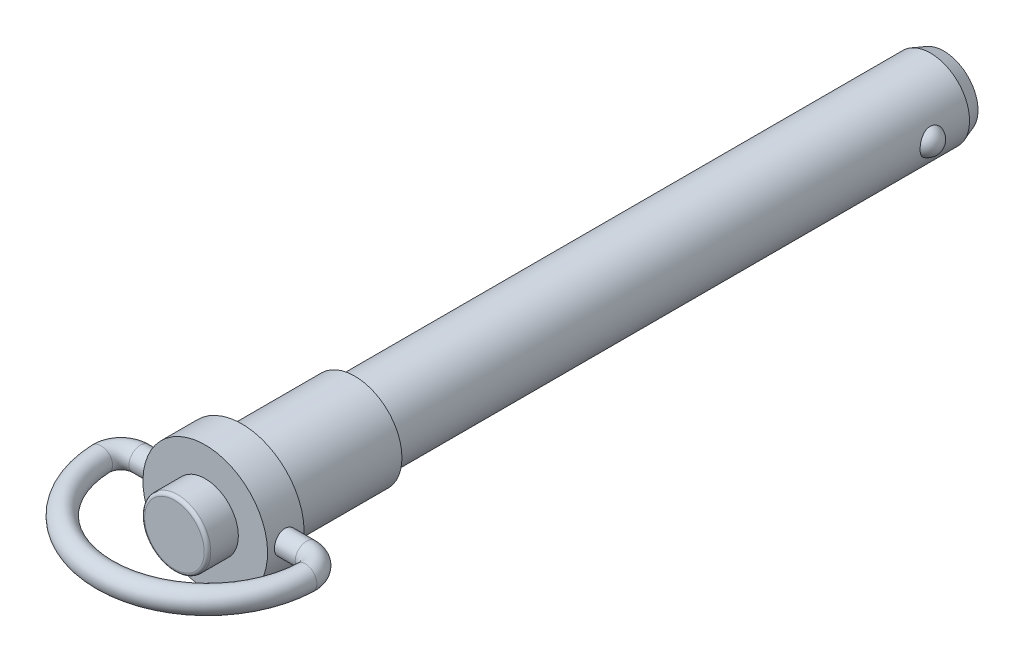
ISO-10303-21;
HEADER;
FILE_DESCRIPTION(('STEP AP214'),'2;1');
FILE_NAME('part.step','',(''),(''),'','','');
FILE_SCHEMA(('AUTOMOTIVE_DESIGN { 1 0 10303 214 1 1 1 1 }'));
ENDSEC;
DATA;
#1=APPLICATION_CONTEXT('core data for automotive mechanical design processes');
#2=APPLICATION_PROTOCOL_DEFINITION('international standard','automotive_design',2000,#1);
#3=PRODUCT_CONTEXT('',#1,'mechanical');
#4=PRODUCT('Part','Part','',(#3));
#5=PRODUCT_RELATED_PRODUCT_CATEGORY('part','',(#4));
#6=PRODUCT_DEFINITION_FORMATION('','',#4);
#7=PRODUCT_DEFINITION_CONTEXT('part definition',#1,'design');
#8=PRODUCT_DEFINITION('design','',#6,#7);
#9=PRODUCT_DEFINITION_SHAPE('','',#8);
#10=(LENGTH_UNIT() NAMED_UNIT(*) SI_UNIT(.MILLI.,.METRE.));
#11=(NAMED_UNIT(*) PLANE_ANGLE_UNIT() SI_UNIT($,.RADIAN.));
#12=(NAMED_UNIT(*) SI_UNIT($,.STERADIAN.) SOLID_ANGLE_UNIT());
#13=UNCERTAINTY_MEASURE_WITH_UNIT(LENGTH_MEASURE(1.E-05),#10,'distance_accuracy_value','');
#14=(GEOMETRIC_REPRESENTATION_CONTEXT(3) GLOBAL_UNCERTAINTY_ASSIGNED_CONTEXT((#13)) GLOBAL_UNIT_ASSIGNED_CONTEXT((#10,
#11,#12)) REPRESENTATION_CONTEXT('',''));
#15=CARTESIAN_POINT('',(0.,0.,0.));
#16=DIRECTION('',(0.,0.,1.));
#17=DIRECTION('',(1.,0.,0.));
#18=AXIS2_PLACEMENT_3D('',#15,#16,#17);
#19=CARTESIAN_POINT('',(0.,0.,27.575));
#20=DIRECTION('',(0.,0.,1.));
#21=DIRECTION('',(1.,0.,0.));
#22=AXIS2_PLACEMENT_3D('',#19,#20,#21);
#23=PLANE('',#22);
#24=CARTESIAN_POINT('',(0.,0.,27.575));
#25=DIRECTION('',(0.,0.,1.));
#26=DIRECTION('',(1.,0.,0.));
#27=AXIS2_PLACEMENT_3D('',#24,#25,#26);
#28=CIRCLE('',#27,4.5546);
#29=CARTESIAN_POINT('',(4.5546,0.,27.575));
#30=VERTEX_POINT('',#29);
#31=EDGE_CURVE('E144',#30,#30,#28,.T.);
#32=ORIENTED_EDGE('',*,*,#31,.T.);
#33=EDGE_LOOP('',(#32));
#34=FACE_BOUND('',#33,.T.);
#35=ADVANCED_FACE('F12',(#34),#23,.T.);
#36=CARTESIAN_POINT('',(0.,0.,22.5357550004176));
#37=DIRECTION('',(0.,1.,0.));
#38=DIRECTION('',(0.,0.,1.));
#39=AXIS2_PLACEMENT_3D('',#36,#37,#38);
#40=TOROIDAL_SURFACE('',#39,15.6980038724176,1.75);
#41=CARTESIAN_POINT('',(-15.6851704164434,0.,23.1703844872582));
#42=DIRECTION('',(-0.0404274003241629,0.,-0.999182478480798));
#43=DIRECTION('',(-0.999182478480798,0.,0.0404274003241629));
#44=AXIS2_PLACEMENT_3D('',#41,#42,#43);
#45=CIRCLE('',#44,1.75);
#46=CARTESIAN_POINT('',(-17.4337397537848,0.,23.2411324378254));
#47=VERTEX_POINT('',#46);
#48=EDGE_CURVE('E145',#47,#47,#45,.T.);
#49=CARTESIAN_POINT('',(15.6851704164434,0.,23.1703844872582));
#50=DIRECTION('',(-0.0404274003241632,0.,0.999182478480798));
#51=DIRECTION('',(0.999182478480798,0.,0.0404274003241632));
#52=AXIS2_PLACEMENT_3D('',#49,#50,#51);
#53=CIRCLE('',#52,1.75);
#54=CARTESIAN_POINT('',(17.4337397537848,0.,23.2411324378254));
#55=VERTEX_POINT('',#54);
#56=EDGE_CURVE('E137',#55,#55,#53,.T.);
#57=CARTESIAN_POINT('',(0.,0.,22.5357550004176));
#58=DIRECTION('',(0.,1.,0.));
#59=DIRECTION('',(0.,0.,1.));
#60=AXIS2_PLACEMENT_3D('',#57,#58,#59);
#61=CIRCLE('',#60,17.4480038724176);
#62=EDGE_CURVE('',#47,#55,#61,.T.);
#63=ORIENTED_EDGE('',*,*,#48,.F.);
#64=ORIENTED_EDGE('',*,*,#56,.T.);
#65=ORIENTED_EDGE('',*,*,#62,.T.);
#66=ORIENTED_EDGE('',*,*,#62,.F.);
#67=EDGE_LOOP('',(#63,#65,#64,#66));
#68=FACE_BOUND('',#67,.T.);
#69=ADVANCED_FACE('F74',(#68),#40,.T.);
#70=CARTESIAN_POINT('',(0.,0.,27.075));
#71=DIRECTION('',(0.,0.,1.));
#72=DIRECTION('',(1.,0.,0.));
#73=AXIS2_PLACEMENT_3D('',#70,#71,#72);
#74=TOROIDAL_SURFACE('',#73,4.5546,0.5);
#75=CARTESIAN_POINT('',(0.,0.,27.075));
#76=DIRECTION('',(0.,0.,1.));
#77=DIRECTION('',(1.,0.,0.));
#78=AXIS2_PLACEMENT_3D('',#75,#76,#77);
#79=CIRCLE('',#78,5.0546);
#80=CARTESIAN_POINT('',(5.0546,0.,27.075));
#81=VERTEX_POINT('',#80);
#82=EDGE_CURVE('E150',#81,#81,#79,.T.);
#83=ORIENTED_EDGE('',*,*,#82,.T.);
#84=EDGE_LOOP('',(#83));
#85=FACE_BOUND('',#84,.T.);
#86=ORIENTED_EDGE('',*,*,#31,.F.);
#87=EDGE_LOOP('',(#86));
#88=FACE_BOUND('',#87,.T.);
#89=ADVANCED_FACE('F80',(#85,#88),#74,.T.);
#90=CARTESIAN_POINT('',(12.7038508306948,0.,23.0497588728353));
#91=DIRECTION('',(0.,1.,0.));
#92=DIRECTION('',(0.,0.,1.));
#93=AXIS2_PLACEMENT_3D('',#90,#91,#92);
#94=TOROIDAL_SURFACE('',#93,2.98375887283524,1.75);
#95=CARTESIAN_POINT('',(12.7038508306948,0.,20.066));
#96=DIRECTION('',(1.,0.,0.));
#97=DIRECTION('',(0.,0.,-1.));
#98=AXIS2_PLACEMENT_3D('',#95,#96,#97);
#99=CIRCLE('',#98,1.75);
#100=CARTESIAN_POINT('',(12.7038508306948,0.,18.316));
#101=VERTEX_POINT('',#100);
#102=EDGE_CURVE('E140',#101,#101,#99,.T.);
#103=CARTESIAN_POINT('',(12.7038508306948,0.,23.0497588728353));
#104=DIRECTION('',(0.,1.,0.));
#105=DIRECTION('',(0.,0.,1.));
#106=AXIS2_PLACEMENT_3D('',#103,#104,#105);
#107=CIRCLE('',#106,4.73375887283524);
#108=EDGE_CURVE('',#55,#101,#107,.T.);
#109=ORIENTED_EDGE('',*,*,#56,.F.);
#110=ORIENTED_EDGE('',*,*,#102,.T.);
#111=ORIENTED_EDGE('',*,*,#108,.T.);
#112=ORIENTED_EDGE('',*,*,#108,.F.);
#113=EDGE_LOOP('',(#109,#111,#110,#112));
#114=FACE_BOUND('',#113,.T.);
#115=ADVANCED_FACE('F90',(#114),#94,.T.);
#116=CARTESIAN_POINT('',(-12.7038508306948,0.,23.0497588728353));
#117=DIRECTION('',(0.,1.,0.));
#118=DIRECTION('',(0.,0.,1.));
#119=AXIS2_PLACEMENT_3D('',#116,#117,#118);
#120=TOROIDAL_SURFACE('',#119,2.98375887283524,1.75);
#121=CARTESIAN_POINT('',(-12.7038508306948,0.,20.066));
#122=DIRECTION('',(1.,0.,0.));
#123=DIRECTION('',(0.,0.,-1.));
#124=AXIS2_PLACEMENT_3D('',#121,#122,#123);
#125=CIRCLE('',#124,1.75);
#126=CARTESIAN_POINT('',(-12.7038508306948,0.,18.316));
#127=VERTEX_POINT('',#126);
#128=EDGE_CURVE('E307',#127,#127,#125,.T.);
#129=CARTESIAN_POINT('',(-12.7038508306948,0.,23.0497588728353));
#130=DIRECTION('',(0.,1.,0.));
#131=DIRECTION('',(0.,0.,1.));
#132=AXIS2_PLACEMENT_3D('',#129,#130,#131);
#133=CIRCLE('',#132,4.73375887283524);
#134=EDGE_CURVE('',#127,#47,#133,.T.);
#135=ORIENTED_EDGE('',*,*,#128,.F.);
#136=ORIENTED_EDGE('',*,*,#48,.T.);
#137=ORIENTED_EDGE('',*,*,#134,.T.);
#138=ORIENTED_EDGE('',*,*,#134,.F.);
#139=EDGE_LOOP('',(#135,#137,#136,#138));
#140=FACE_BOUND('',#139,.T.);
#141=ADVANCED_FACE('F105',(#140),#120,.T.);
#142=CARTESIAN_POINT('',(0.,0.,28.575));
#143=DIRECTION('',(0.,0.,-1.));
#144=DIRECTION('',(0.,-1.,0.));
#145=AXIS2_PLACEMENT_3D('',#142,#143,#144);
#146=CYLINDRICAL_SURFACE('',#145,5.0546);
#147=ORIENTED_EDGE('',*,*,#82,.F.);
#148=EDGE_LOOP('',(#147));
#149=FACE_BOUND('',#148,.T.);
#150=CARTESIAN_POINT('',(0.,0.,22.86));
#151=DIRECTION('',(0.,0.,-1.));
#152=DIRECTION('',(0.,-1.,0.));
#153=AXIS2_PLACEMENT_3D('',#150,#151,#152);
#154=CIRCLE('',#153,5.0546);
#155=CARTESIAN_POINT('',(0.,-5.0546,22.86));
#156=VERTEX_POINT('',#155);
#157=EDGE_CURVE('E122',#156,#156,#154,.T.);
#158=ORIENTED_EDGE('',*,*,#157,.F.);
#159=EDGE_LOOP('',(#158));
#160=FACE_BOUND('',#159,.T.);
#161=ADVANCED_FACE('F102',(#149,#160),#146,.T.);
#162=CARTESIAN_POINT('',(12.7038508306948,0.,20.066));
#163=DIRECTION('',(-1.,0.,0.));
#164=DIRECTION('',(0.,0.,1.));
#165=AXIS2_PLACEMENT_3D('',#162,#163,#164);
#166=CYLINDRICAL_SURFACE('',#165,1.75);
#167=CARTESIAN_POINT('',(9.525,0.,21.816));
#168=CARTESIAN_POINT('',(9.52499824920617,0.0974196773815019,21.8159962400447));
#169=CARTESIAN_POINT('',(9.52348996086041,0.194888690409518,21.8078377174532));
#170=CARTESIAN_POINT('',(9.51761845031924,0.387082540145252,21.7754387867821));
#171=CARTESIAN_POINT('',(9.5132527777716,0.481804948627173,21.7511845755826));
#172=CARTESIAN_POINT('',(9.50215510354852,0.66569803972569,21.6873599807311));
#173=CARTESIAN_POINT('',(9.49542520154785,0.75487356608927,21.6478031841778));
#174=CARTESIAN_POINT('',(9.48033492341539,0.925313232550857,21.5545343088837));
#175=CARTESIAN_POINT('',(9.4719746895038,1.00657806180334,21.5008234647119));
#176=CARTESIAN_POINT('',(9.45443959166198,1.15983447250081,21.38011409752));
#177=CARTESIAN_POINT('',(9.44525721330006,1.23172173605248,21.3129842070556));
#178=CARTESIAN_POINT('',(9.42716883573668,1.36328019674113,21.1676249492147));
#179=CARTESIAN_POINT('',(9.41826285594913,1.42295053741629,21.0893948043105));
#180=CARTESIAN_POINT('',(9.40166266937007,1.52881224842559,20.9233223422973));
#181=CARTESIAN_POINT('',(9.39397815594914,1.57489805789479,20.8354116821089));
#182=CARTESIAN_POINT('',(9.3807965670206,1.65160688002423,20.6529311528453));
#183=CARTESIAN_POINT('',(9.3752993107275,1.68223117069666,20.5583618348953));
#184=CARTESIAN_POINT('',(9.36719014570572,1.72681399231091,20.3663627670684));
#185=CARTESIAN_POINT('',(9.36454682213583,1.74095411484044,20.2689765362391));
#186=CARTESIAN_POINT('',(9.36235004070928,1.75273074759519,20.0731807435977));
#187=CARTESIAN_POINT('',(9.3627963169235,1.75036867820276,19.9747712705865));
#188=CARTESIAN_POINT('',(9.36669969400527,1.72935535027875,19.7810343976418));
#189=CARTESIAN_POINT('',(9.37011871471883,1.71091010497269,19.6856837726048));
#190=CARTESIAN_POINT('',(9.37952256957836,1.65857824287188,19.49945389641));
#191=CARTESIAN_POINT('',(9.38550750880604,1.62469099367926,19.4085748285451));
#192=CARTESIAN_POINT('',(9.39940890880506,1.54223419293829,19.2332623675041));
#193=CARTESIAN_POINT('',(9.40733632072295,1.49358101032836,19.1488692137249));
#194=CARTESIAN_POINT('',(9.42422213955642,1.38303261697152,18.98936699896));
#195=CARTESIAN_POINT('',(9.43318064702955,1.32113611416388,18.9142588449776));
#196=CARTESIAN_POINT('',(9.45128545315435,1.184745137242,18.77426795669));
#197=CARTESIAN_POINT('',(9.46043254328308,1.11007434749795,18.7095569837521));
#198=CARTESIAN_POINT('',(9.47775926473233,0.950845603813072,18.5935547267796));
#199=CARTESIAN_POINT('',(9.48593888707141,0.866287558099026,18.5422635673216));
#200=CARTESIAN_POINT('',(9.50042458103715,0.689508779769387,18.4545334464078));
#201=CARTESIAN_POINT('',(9.50672846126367,0.597279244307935,18.4181118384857));
#202=CARTESIAN_POINT('',(9.51673535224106,0.407869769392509,18.3613256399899));
#203=CARTESIAN_POINT('',(9.52043862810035,0.310690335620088,18.3409594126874));
#204=CARTESIAN_POINT('',(9.5247907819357,0.115617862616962,18.3170999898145));
#205=CARTESIAN_POINT('',(9.52548227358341,0.0177545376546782,18.313371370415));
#206=CARTESIAN_POINT('',(9.52385046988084,-0.17719740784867,18.3222622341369));
#207=CARTESIAN_POINT('',(9.52152731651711,-0.274286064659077,18.3348809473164));
#208=CARTESIAN_POINT('',(9.51415375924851,-0.46418965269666,18.3759125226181));
#209=CARTESIAN_POINT('',(9.50912384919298,-0.557031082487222,18.4042067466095));
#210=CARTESIAN_POINT('',(9.49689842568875,-0.736652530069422,18.4756581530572));
#211=CARTESIAN_POINT('',(9.48970276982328,-0.823432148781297,18.5188163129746));
#212=CARTESIAN_POINT('',(9.47383776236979,-0.98947475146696,18.6192949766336));
#213=CARTESIAN_POINT('',(9.46515367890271,-1.06864888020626,18.676759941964));
#214=CARTESIAN_POINT('',(9.44731421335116,-1.21631462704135,18.8040249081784));
#215=CARTESIAN_POINT('',(9.43815878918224,-1.28480528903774,18.873826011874));
#216=CARTESIAN_POINT('',(9.42026781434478,-1.41005035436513,19.0248458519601));
#217=CARTESIAN_POINT('',(9.41153908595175,-1.46664438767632,19.1061985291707));
#218=CARTESIAN_POINT('',(9.39562517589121,-1.56536359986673,19.277394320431));
#219=CARTESIAN_POINT('',(9.38843993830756,-1.60748930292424,19.3672371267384));
#220=CARTESIAN_POINT('',(9.3764796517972,-1.67584630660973,19.5524479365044));
#221=CARTESIAN_POINT('',(9.37169329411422,-1.70215230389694,19.6477876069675));
#222=CARTESIAN_POINT('',(9.36504636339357,-1.73835449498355,19.8416293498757));
#223=CARTESIAN_POINT('',(9.36318547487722,-1.7482524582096,19.9401310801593));
#224=CARTESIAN_POINT('',(9.3626157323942,-1.75130025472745,20.1358954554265));
#225=CARTESIAN_POINT('',(9.36385929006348,-1.74470294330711,20.2331541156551));
#226=CARTESIAN_POINT('',(9.36925303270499,-1.71549975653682,20.4251511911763));
#227=CARTESIAN_POINT('',(9.37340320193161,-1.69289396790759,20.5198896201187));
#228=CARTESIAN_POINT('',(9.38412287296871,-1.63242039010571,20.7040281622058));
#229=CARTESIAN_POINT('',(9.39068820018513,-1.5945789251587,20.7934371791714));
#230=CARTESIAN_POINT('',(9.40550157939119,-1.50473547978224,20.964677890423));
#231=CARTESIAN_POINT('',(9.41374974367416,-1.45273255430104,21.0465090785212));
#232=CARTESIAN_POINT('',(9.43114776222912,-1.33515884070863,21.2015399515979));
#233=CARTESIAN_POINT('',(9.44030888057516,-1.26940363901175,21.2745985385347));
#234=CARTESIAN_POINT('',(9.45841527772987,-1.12657740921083,21.4087295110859));
#235=CARTESIAN_POINT('',(9.4673605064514,-1.04950378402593,21.4697991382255));
#236=CARTESIAN_POINT('',(9.4841172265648,-0.885436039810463,21.5787070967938));
#237=CARTESIAN_POINT('',(9.49191831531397,-0.798362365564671,21.6264272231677));
#238=CARTESIAN_POINT('',(9.50540634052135,-0.617319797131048,21.7064857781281));
#239=CARTESIAN_POINT('',(9.51109528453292,-0.523357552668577,21.7388388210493));
#240=CARTESIAN_POINT('',(9.51854259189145,-0.357584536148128,21.7805891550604));
#241=CARTESIAN_POINT('',(9.52095058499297,-0.286749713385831,21.7938458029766));
#242=CARTESIAN_POINT('',(9.52417991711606,-0.143952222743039,21.8115525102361));
#243=CARTESIAN_POINT('',(9.52500129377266,-0.0719895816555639,21.8160027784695));
#244=CARTESIAN_POINT('',(9.525,0.,21.816));
#245=B_SPLINE_CURVE_WITH_KNOTS('',3,(#167,#168,#169,#170,#171,#172,#173,#174,#175,#176,#177,
#178,#179,#180,#181,#182,#183,#184,#185,#186,#187,#188,#189,#190,#191,#192,#193,#194,#195,#196,
#197,#198,#199,#200,#201,#202,#203,#204,#205,#206,#207,#208,#209,#210,#211,#212,#213,#214,#215,
#216,#217,#218,#219,#220,#221,#222,#223,#224,#225,#226,#227,#228,#229,#230,#231,#232,#233,#234,
#235,#236,#237,#238,#239,#240,#241,#242,#243,#244),.UNSPECIFIED.,.T.,.F.,(4,2,2,2,2,2,2,2,2,2,2,
2,2,2,2,2,2,2,2,2,2,2,2,2,2,2,2,2,2,2,2,2,2,2,2,2,2,2,4),(0.,0.291995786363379,
0.584242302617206,0.876229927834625,1.16819209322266,1.46316632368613,1.75816122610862,
2.05539140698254,2.35259701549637,2.64649667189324,2.94037103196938,3.23053548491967,
3.52071182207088,3.81256333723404,4.10444333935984,4.40073615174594,4.69703171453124,
4.9936720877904,5.29028221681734,5.58268169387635,5.87506739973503,6.1652698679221,
6.45549142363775,6.74877158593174,7.04207797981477,7.3391152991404,7.63614185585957,
7.93175468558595,8.22733563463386,8.51841349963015,8.80948978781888,9.10006529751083,
9.39066020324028,9.68543533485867,9.98027821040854,10.2776546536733,10.574747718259,
10.7905270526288,11.0063012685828),.UNSPECIFIED.);
#246=CARTESIAN_POINT('',(9.525,0.,21.816));
#247=VERTEX_POINT('',#246);
#248=EDGE_CURVE('E29',#247,#247,#245,.T.);
#249=ORIENTED_EDGE('',*,*,#248,.F.);
#250=EDGE_LOOP('',(#249));
#251=FACE_BOUND('',#250,.T.);
#252=ORIENTED_EDGE('',*,*,#102,.F.);
#253=EDGE_LOOP('',(#252));
#254=FACE_BOUND('',#253,.T.);
#255=ADVANCED_FACE('F85',(#251,#254),#166,.T.);
#256=CARTESIAN_POINT('',(-12.7038508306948,0.,20.066));
#257=DIRECTION('',(1.,0.,0.));
#258=DIRECTION('',(0.,0.,-1.));
#259=AXIS2_PLACEMENT_3D('',#256,#257,#258);
#260=CYLINDRICAL_SURFACE('',#259,1.75);
#261=CARTESIAN_POINT('',(-9.525,0.,18.316));
#262=CARTESIAN_POINT('',(-9.52499824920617,-0.097419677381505,18.3160037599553));
#263=CARTESIAN_POINT('',(-9.52348996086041,-0.194888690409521,18.3241622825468));
#264=CARTESIAN_POINT('',(-9.51761845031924,-0.387082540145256,18.3565612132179));
#265=CARTESIAN_POINT('',(-9.5132527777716,-0.481804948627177,18.3808154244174));
#266=CARTESIAN_POINT('',(-9.50215510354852,-0.665698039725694,18.4446400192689));
#267=CARTESIAN_POINT('',(-9.49542520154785,-0.754873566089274,18.4841968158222));
#268=CARTESIAN_POINT('',(-9.48033492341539,-0.925313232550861,18.5774656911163));
#269=CARTESIAN_POINT('',(-9.4719746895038,-1.00657806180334,18.6311765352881));
#270=CARTESIAN_POINT('',(-9.45443959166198,-1.15983447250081,18.75188590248));
#271=CARTESIAN_POINT('',(-9.44525721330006,-1.23172173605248,18.8190157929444));
#272=CARTESIAN_POINT('',(-9.42716883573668,-1.36328019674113,18.9643750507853));
#273=CARTESIAN_POINT('',(-9.41826285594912,-1.4229505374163,19.0426051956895));
#274=CARTESIAN_POINT('',(-9.40166266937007,-1.52881224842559,19.2086776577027));
#275=CARTESIAN_POINT('',(-9.39397815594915,-1.57489805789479,19.2965883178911));
#276=CARTESIAN_POINT('',(-9.3807965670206,-1.65160688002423,19.4790688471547));
#277=CARTESIAN_POINT('',(-9.3752993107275,-1.68223117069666,19.5736381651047));
#278=CARTESIAN_POINT('',(-9.36719014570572,-1.72681399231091,19.7656372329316));
#279=CARTESIAN_POINT('',(-9.36454682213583,-1.74095411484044,19.8630234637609));
#280=CARTESIAN_POINT('',(-9.36235004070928,-1.7527307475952,20.0588192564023));
#281=CARTESIAN_POINT('',(-9.3627963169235,-1.75036867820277,20.1572287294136));
#282=CARTESIAN_POINT('',(-9.36669969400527,-1.72935535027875,20.3509656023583));
#283=CARTESIAN_POINT('',(-9.37011871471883,-1.71091010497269,20.4463162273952));
#284=CARTESIAN_POINT('',(-9.37952256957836,-1.65857824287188,20.63254610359));
#285=CARTESIAN_POINT('',(-9.38550750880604,-1.62469099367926,20.7234251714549));
#286=CARTESIAN_POINT('',(-9.39940890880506,-1.54223419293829,20.8987376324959));
#287=CARTESIAN_POINT('',(-9.40733632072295,-1.49358101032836,20.9831307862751));
#288=CARTESIAN_POINT('',(-9.42422213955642,-1.38303261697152,21.14263300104));
#289=CARTESIAN_POINT('',(-9.43318064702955,-1.32113611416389,21.2177411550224));
#290=CARTESIAN_POINT('',(-9.45128545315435,-1.184745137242,21.35773204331));
#291=CARTESIAN_POINT('',(-9.46043254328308,-1.11007434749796,21.4224430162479));
#292=CARTESIAN_POINT('',(-9.47775926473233,-0.950845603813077,21.5384452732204));
#293=CARTESIAN_POINT('',(-9.48593888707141,-0.86628755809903,21.5897364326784));
#294=CARTESIAN_POINT('',(-9.50042458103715,-0.689508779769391,21.6774665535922));
#295=CARTESIAN_POINT('',(-9.50672846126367,-0.597279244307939,21.7138881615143));
#296=CARTESIAN_POINT('',(-9.51673535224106,-0.407869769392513,21.7706743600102));
#297=CARTESIAN_POINT('',(-9.52043862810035,-0.310690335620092,21.7910405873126));
#298=CARTESIAN_POINT('',(-9.5247907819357,-0.115617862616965,21.8149000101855));
#299=CARTESIAN_POINT('',(-9.52548227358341,-0.0177545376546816,21.818628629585));
#300=CARTESIAN_POINT('',(-9.52385046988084,0.177197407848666,21.8097377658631));
#301=CARTESIAN_POINT('',(-9.52152731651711,0.274286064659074,21.7971190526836));
#302=CARTESIAN_POINT('',(-9.51415375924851,0.464189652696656,21.7560874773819));
#303=CARTESIAN_POINT('',(-9.50912384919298,0.557031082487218,21.7277932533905));
#304=CARTESIAN_POINT('',(-9.49689842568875,0.736652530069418,21.6563418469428));
#305=CARTESIAN_POINT('',(-9.48970276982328,0.823432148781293,21.6131836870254));
#306=CARTESIAN_POINT('',(-9.47383776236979,0.989474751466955,21.5127050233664));
#307=CARTESIAN_POINT('',(-9.46515367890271,1.06864888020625,21.455240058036));
#308=CARTESIAN_POINT('',(-9.44731421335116,1.21631462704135,21.3279750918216));
#309=CARTESIAN_POINT('',(-9.43815878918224,1.28480528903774,21.258173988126));
#310=CARTESIAN_POINT('',(-9.42026781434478,1.41005035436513,21.1071541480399));
#311=CARTESIAN_POINT('',(-9.41153908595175,1.46664438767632,21.0258014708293));
#312=CARTESIAN_POINT('',(-9.39562517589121,1.56536359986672,20.854605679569));
#313=CARTESIAN_POINT('',(-9.38843993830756,1.60748930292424,20.7647628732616));
#314=CARTESIAN_POINT('',(-9.3764796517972,1.67584630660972,20.5795520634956));
#315=CARTESIAN_POINT('',(-9.37169329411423,1.70215230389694,20.4842123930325));
#316=CARTESIAN_POINT('',(-9.36504636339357,1.73835449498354,20.2903706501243));
#317=CARTESIAN_POINT('',(-9.36318547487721,1.74825245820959,20.1918689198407));
#318=CARTESIAN_POINT('',(-9.3626157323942,1.75130025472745,19.9961045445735));
#319=CARTESIAN_POINT('',(-9.36385929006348,1.74470294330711,19.8988458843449));
#320=CARTESIAN_POINT('',(-9.36925303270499,1.71549975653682,19.7068488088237));
#321=CARTESIAN_POINT('',(-9.3734032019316,1.69289396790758,19.6121103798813));
#322=CARTESIAN_POINT('',(-9.3841228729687,1.6324203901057,19.4279718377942));
#323=CARTESIAN_POINT('',(-9.39068820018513,1.5945789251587,19.3385628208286));
#324=CARTESIAN_POINT('',(-9.40550157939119,1.50473547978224,19.167322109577));
#325=CARTESIAN_POINT('',(-9.41374974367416,1.45273255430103,19.0854909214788));
#326=CARTESIAN_POINT('',(-9.43114776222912,1.33515884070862,18.9304600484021));
#327=CARTESIAN_POINT('',(-9.44030888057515,1.26940363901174,18.8574014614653));
#328=CARTESIAN_POINT('',(-9.45841527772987,1.12657740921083,18.7232704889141));
#329=CARTESIAN_POINT('',(-9.4673605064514,1.04950378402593,18.6622008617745));
#330=CARTESIAN_POINT('',(-9.4841172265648,0.885436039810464,18.5532929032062));
#331=CARTESIAN_POINT('',(-9.49191831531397,0.798362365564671,18.5055727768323));
#332=CARTESIAN_POINT('',(-9.50540634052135,0.617319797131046,18.4255142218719));
#333=CARTESIAN_POINT('',(-9.51109528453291,0.523357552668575,18.3931611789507));
#334=CARTESIAN_POINT('',(-9.51854259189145,0.357584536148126,18.3514108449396));
#335=CARTESIAN_POINT('',(-9.52095058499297,0.286749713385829,18.3381541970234));
#336=CARTESIAN_POINT('',(-9.52417991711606,0.143952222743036,18.3204474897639));
#337=CARTESIAN_POINT('',(-9.52500129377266,0.0719895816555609,18.3159972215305));
#338=CARTESIAN_POINT('',(-9.525,0.,18.316));
#339=B_SPLINE_CURVE_WITH_KNOTS('',3,(#261,#262,#263,#264,#265,#266,#267,#268,#269,#270,#271,
#272,#273,#274,#275,#276,#277,#278,#279,#280,#281,#282,#283,#284,#285,#286,#287,#288,#289,#290,
#291,#292,#293,#294,#295,#296,#297,#298,#299,#300,#301,#302,#303,#304,#305,#306,#307,#308,#309,
#310,#311,#312,#313,#314,#315,#316,#317,#318,#319,#320,#321,#322,#323,#324,#325,#326,#327,#328,
#329,#330,#331,#332,#333,#334,#335,#336,#337,#338),.UNSPECIFIED.,.T.,.F.,(4,2,2,2,2,2,2,2,2,2,2,
2,2,2,2,2,2,2,2,2,2,2,2,2,2,2,2,2,2,2,2,2,2,2,2,2,2,2,4),(0.,0.291995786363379,
0.584242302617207,0.876229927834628,1.16819209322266,1.46316632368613,1.75816122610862,
2.05539140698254,2.35259701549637,2.64649667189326,2.94037103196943,3.23053548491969,
3.52071182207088,3.81256333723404,4.10444333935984,4.40073615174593,4.69703171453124,
4.9936720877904,5.29028221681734,5.58268169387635,5.87506739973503,6.1652698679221,
6.45549142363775,6.74877158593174,7.04207797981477,7.3391152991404,7.63614185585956,
7.93175468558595,8.22733563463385,8.51841349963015,8.80948978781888,9.10006529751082,
9.39066020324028,9.68543533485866,9.98027821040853,10.2776546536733,10.574747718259,
10.7905270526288,11.0063012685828),.UNSPECIFIED.);
#340=CARTESIAN_POINT('',(-9.525,0.,18.316));
#341=VERTEX_POINT('',#340);
#342=EDGE_CURVE('E20',#341,#341,#339,.T.);
#343=ORIENTED_EDGE('',*,*,#342,.T.);
#344=EDGE_LOOP('',(#343));
#345=FACE_BOUND('',#344,.T.);
#346=ORIENTED_EDGE('',*,*,#128,.T.);
#347=EDGE_LOOP('',(#346));
#348=FACE_BOUND('',#347,.T.);
#349=ADVANCED_FACE('F110',(#345,#348),#260,.T.);
#350=CARTESIAN_POINT('',(-9.525,0.,22.86));
#351=DIRECTION('',(0.,0.,1.));
#352=DIRECTION('',(0.,1.,0.));
#353=AXIS2_PLACEMENT_3D('',#350,#351,#352);
#354=PLANE('',#353);
#355=ORIENTED_EDGE('',*,*,#157,.T.);
#356=EDGE_LOOP('',(#355));
#357=FACE_BOUND('',#356,.T.);
#358=CARTESIAN_POINT('',(0.,0.,22.86));
#359=DIRECTION('',(0.,0.,-1.));
#360=DIRECTION('',(0.,-1.,0.));
#361=AXIS2_PLACEMENT_3D('',#358,#359,#360);
#362=CIRCLE('',#361,9.525);
#363=CARTESIAN_POINT('',(0.,-9.525,22.86));
#364=VERTEX_POINT('',#363);
#365=EDGE_CURVE('E163',#364,#364,#362,.T.);
#366=ORIENTED_EDGE('',*,*,#365,.F.);
#367=EDGE_LOOP('',(#366));
#368=FACE_BOUND('',#367,.T.);
#369=ADVANCED_FACE('F107',(#357,#368),#354,.T.);
#370=CARTESIAN_POINT('',(0.,0.,0.));
#371=DIRECTION('',(0.,0.,-1.));
#372=DIRECTION('',(0.,-1.,0.));
#373=AXIS2_PLACEMENT_3D('',#370,#371,#372);
#374=CYLINDRICAL_SURFACE('',#373,9.525);
#375=CARTESIAN_POINT('',(0.,0.,17.272));
#376=DIRECTION('',(0.,0.,-1.));
#377=DIRECTION('',(0.,-1.,0.));
#378=AXIS2_PLACEMENT_3D('',#375,#376,#377);
#379=CIRCLE('',#378,9.525);
#380=CARTESIAN_POINT('',(0.,-9.525,17.272));
#381=VERTEX_POINT('',#380);
#382=EDGE_CURVE('E25',#381,#381,#379,.T.);
#383=ORIENTED_EDGE('',*,*,#382,.F.);
#384=EDGE_LOOP('',(#383));
#385=FACE_BOUND('',#384,.T.);
#386=ORIENTED_EDGE('',*,*,#365,.T.);
#387=EDGE_LOOP('',(#386));
#388=FACE_BOUND('',#387,.T.);
#389=ORIENTED_EDGE('',*,*,#342,.F.);
#390=EDGE_LOOP('',(#389));
#391=FACE_BOUND('',#390,.T.);
#392=ORIENTED_EDGE('',*,*,#248,.T.);
#393=EDGE_LOOP('',(#392));
#394=FACE_BOUND('',#393,.T.);
#395=ADVANCED_FACE('F109',(#385,#388,#391,#394),#374,.T.);
#396=CARTESIAN_POINT('',(-8.9535,0.,17.272));
#397=DIRECTION('',(0.,0.,-1.));
#398=DIRECTION('',(0.,-1.,0.));
#399=AXIS2_PLACEMENT_3D('',#396,#397,#398);
#400=PLANE('',#399);
#401=ORIENTED_EDGE('',*,*,#382,.T.);
#402=EDGE_LOOP('',(#401));
#403=FACE_BOUND('',#402,.T.);
#404=CARTESIAN_POINT('',(0.,0.,17.272));
#405=DIRECTION('',(0.,0.,1.));
#406=DIRECTION('',(1.,0.,0.));
#407=AXIS2_PLACEMENT_3D('',#404,#405,#406);
#408=CIRCLE('',#407,7.6);
#409=CARTESIAN_POINT('',(7.6,0.,17.272));
#410=VERTEX_POINT('',#409);
#411=EDGE_CURVE('E153',#410,#410,#408,.T.);
#412=ORIENTED_EDGE('',*,*,#411,.T.);
#413=EDGE_LOOP('',(#412));
#414=FACE_BOUND('',#413,.T.);
#415=ADVANCED_FACE('F96',(#403,#414),#400,.T.);
#416=CARTESIAN_POINT('',(0.,0.,16.872));
#417=DIRECTION('',(0.,0.,1.));
#418=DIRECTION('',(1.,0.,0.));
#419=AXIS2_PLACEMENT_3D('',#416,#417,#418);
#420=TOROIDAL_SURFACE('',#419,7.6,0.4);
#421=CARTESIAN_POINT('',(0.,0.,16.872));
#422=DIRECTION('',(0.,0.,1.));
#423=DIRECTION('',(1.,0.,0.));
#424=AXIS2_PLACEMENT_3D('',#421,#422,#423);
#425=CIRCLE('',#424,7.2);
#426=CARTESIAN_POINT('',(7.2,0.,16.872));
#427=VERTEX_POINT('',#426);
#428=EDGE_CURVE('E156',#427,#427,#425,.T.);
#429=ORIENTED_EDGE('',*,*,#428,.T.);
#430=EDGE_LOOP('',(#429));
#431=FACE_BOUND('',#430,.T.);
#432=ORIENTED_EDGE('',*,*,#411,.F.);
#433=EDGE_LOOP('',(#432));
#434=FACE_BOUND('',#433,.T.);
#435=ADVANCED_FACE('F92',(#431,#434),#420,.F.);
#436=CARTESIAN_POINT('',(0.,0.,30.025216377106));
#437=DIRECTION('',(0.,0.,1.));
#438=DIRECTION('',(1.,0.,0.));
#439=AXIS2_PLACEMENT_3D('',#436,#437,#438);
#440=CYLINDRICAL_SURFACE('',#439,7.2);
#441=CARTESIAN_POINT('',(0.,0.,0.));
#442=DIRECTION('',(0.,0.,1.));
#443=DIRECTION('',(1.,0.,0.));
#444=AXIS2_PLACEMENT_3D('',#441,#442,#443);
#445=CIRCLE('',#444,7.2);
#446=CARTESIAN_POINT('',(7.2,0.,0.));
#447=VERTEX_POINT('',#446);
#448=EDGE_CURVE('E159',#447,#447,#445,.T.);
#449=ORIENTED_EDGE('',*,*,#448,.T.);
#450=EDGE_LOOP('',(#449));
#451=FACE_BOUND('',#450,.T.);
#452=ORIENTED_EDGE('',*,*,#428,.F.);
#453=EDGE_LOOP('',(#452));
#454=FACE_BOUND('',#453,.T.);
#455=ADVANCED_FACE('F95',(#451,#454),#440,.T.);
#456=CARTESIAN_POINT('',(0.,0.,0.));
#457=DIRECTION('',(0.,0.,-1.));
#458=DIRECTION('',(0.,-1.,0.));
#459=AXIS2_PLACEMENT_3D('',#456,#457,#458);
#460=PLANE('',#459);
#461=ORIENTED_EDGE('',*,*,#448,.F.);
#462=EDGE_LOOP('',(#461));
#463=FACE_BOUND('',#462,.T.);
#464=CARTESIAN_POINT('',(0.,0.,0.));
#465=DIRECTION('',(0.,0.,-1.));
#466=DIRECTION('',(0.,1.,0.));
#467=AXIS2_PLACEMENT_3D('',#464,#465,#466);
#468=CIRCLE('',#467,5.969635);
#469=CARTESIAN_POINT('',(0.,5.969635,0.));
#470=VERTEX_POINT('',#469);
#471=EDGE_CURVE('E8',#470,#470,#468,.F.);
#472=ORIENTED_EDGE('',*,*,#471,.T.);
#473=EDGE_LOOP('',(#472));
#474=FACE_BOUND('',#473,.T.);
#475=ADVANCED_FACE('F100',(#463,#474),#460,.T.);
#476=CARTESIAN_POINT('',(-5.23004748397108,0.,-90.0304));
#477=DIRECTION('',(0.,0.,1.));
#478=DIRECTION('',(0.,1.,0.));
#479=AXIS2_PLACEMENT_3D('',#476,#477,#478);
#480=PLANE('',#479);
#481=CARTESIAN_POINT('',(0.,0.,-90.0303999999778));
#482=DIRECTION('',(0.,0.,1.));
#483=DIRECTION('',(0.,1.,0.));
#484=AXIS2_PLACEMENT_3D('',#481,#482,#483);
#485=CIRCLE('',#484,5.23004748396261);
#486=CARTESIAN_POINT('',(0.,5.23004748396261,-90.0303999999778));
#487=VERTEX_POINT('',#486);
#488=EDGE_CURVE('E16',#487,#487,#485,.T.);
#489=ORIENTED_EDGE('',*,*,#488,.F.);
#490=EDGE_LOOP('',(#489));
#491=FACE_BOUND('',#490,.T.);
#492=ADVANCED_FACE('F46',(#491),#480,.F.);
#493=CARTESIAN_POINT('',(-5.24129,0.,-82.2834));
#494=DIRECTION('',(0.,0.,1.));
#495=DIRECTION('',(-1.,0.,0.));
#496=AXIS2_PLACEMENT_3D('',#493,#494,#495);
#497=SPHERICAL_SURFACE('',#496,1.98374);
#498=CARTESIAN_POINT('',(-5.969635,0.,-80.4382067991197));
#499=CARTESIAN_POINT('',(-5.96963006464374,-0.111015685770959,-80.4382116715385));
#500=CARTESIAN_POINT('',(-5.96650644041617,-0.222143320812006,-80.4470278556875));
#501=CARTESIAN_POINT('',(-5.95431160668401,-0.441381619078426,-80.4821762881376));
#502=CARTESIAN_POINT('',(-5.9452309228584,-0.549487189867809,-80.5085364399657));
#503=CARTESIAN_POINT('',(-5.92206953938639,-0.759461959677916,-80.5783068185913));
#504=CARTESIAN_POINT('',(-5.90799052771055,-0.861333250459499,-80.6217112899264));
#505=CARTESIAN_POINT('',(-5.87633956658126,-1.05588670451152,-80.7247452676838));
#506=CARTESIAN_POINT('',(-5.85876868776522,-1.14857167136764,-80.7843698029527));
#507=CARTESIAN_POINT('',(-5.82223010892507,-1.32133430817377,-80.9181231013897));
#508=CARTESIAN_POINT('',(-5.80327429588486,-1.40150415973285,-80.9921358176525));
#509=CARTESIAN_POINT('',(-5.76604946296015,-1.54754922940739,-81.1533071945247));
#510=CARTESIAN_POINT('',(-5.74778035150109,-1.61342635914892,-81.2404640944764));
#511=CARTESIAN_POINT('',(-5.71483308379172,-1.72643370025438,-81.4221868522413));
#512=CARTESIAN_POINT('',(-5.70004608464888,-1.77417349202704,-81.5163531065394));
#513=CARTESIAN_POINT('',(-5.67505831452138,-1.85255616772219,-81.7121159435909));
#514=CARTESIAN_POINT('',(-5.66485545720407,-1.88320683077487,-81.8137091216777));
#515=CARTESIAN_POINT('',(-5.65080765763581,-1.92493419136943,-82.0148687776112));
#516=CARTESIAN_POINT('',(-5.64661793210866,-1.9370751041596,-82.1141910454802));
#517=CARTESIAN_POINT('',(-5.64397531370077,-1.94476367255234,-82.3135411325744));
#518=CARTESIAN_POINT('',(-5.64552102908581,-1.94031535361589,-82.4135687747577));
#519=CARTESIAN_POINT('',(-5.65399944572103,-1.9154603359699,-82.6076677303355));
#520=CARTESIAN_POINT('',(-5.66073469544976,-1.89563839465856,-82.7018234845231));
#521=CARTESIAN_POINT('',(-5.67860059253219,-1.84142507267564,-82.8853806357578));
#522=CARTESIAN_POINT('',(-5.68973152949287,-1.80703273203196,-82.9747817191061));
#523=CARTESIAN_POINT('',(-5.71546454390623,-1.72392617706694,-83.1482988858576));
#524=CARTESIAN_POINT('',(-5.730129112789,-1.67494987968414,-83.2322806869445));
#525=CARTESIAN_POINT('',(-5.75347973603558,-1.59211635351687,-83.3513225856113));
#526=CARTESIAN_POINT('',(-5.7614912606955,-1.56293448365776,-83.38985758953));
#527=CARTESIAN_POINT('',(-5.7777780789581,-1.50160973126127,-83.464489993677));
#528=CARTESIAN_POINT('',(-5.78605358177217,-1.46946445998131,-83.5005853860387));
#529=CARTESIAN_POINT('',(-5.81187985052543,-1.36524181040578,-83.6087062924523));
#530=CARTESIAN_POINT('',(-5.82954302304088,-1.2884006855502,-83.6762048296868));
#531=CARTESIAN_POINT('',(-5.86333936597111,-1.12462015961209,-83.7980676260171));
#532=CARTESIAN_POINT('',(-5.87947206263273,-1.0376776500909,-83.8524278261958));
#533=CARTESIAN_POINT('',(-5.90173079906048,-0.899149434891,-83.9246002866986));
#534=CARTESIAN_POINT('',(-5.90897547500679,-0.85033751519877,-83.9475231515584));
#535=CARTESIAN_POINT('',(-5.92242841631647,-0.750927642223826,-83.9893690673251));
#536=CARTESIAN_POINT('',(-5.92863755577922,-0.700331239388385,-84.0082954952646));
#537=CARTESIAN_POINT('',(-5.93985979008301,-0.597720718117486,-84.0420647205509));
#538=CARTESIAN_POINT('',(-5.9448739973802,-0.545707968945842,-84.0569113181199));
#539=CARTESIAN_POINT('',(-5.95358843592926,-0.440577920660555,-84.08248082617));
#540=CARTESIAN_POINT('',(-5.95728882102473,-0.387460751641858,-84.093204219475));
#541=CARTESIAN_POINT('',(-5.96337469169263,-0.278836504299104,-84.11074630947));
#542=CARTESIAN_POINT('',(-5.96571659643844,-0.223305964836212,-84.1174358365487));
#543=CARTESIAN_POINT('',(-5.96884799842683,-0.111859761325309,-84.1263605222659));
#544=CARTESIAN_POINT('',(-5.96963748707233,-0.0559440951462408,-84.1285956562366));
#545=CARTESIAN_POINT('',(-5.96963006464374,0.111015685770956,-84.1285883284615));
#546=CARTESIAN_POINT('',(-5.96650644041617,0.222143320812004,-84.1197721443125));
#547=CARTESIAN_POINT('',(-5.95431160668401,0.441381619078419,-84.0846237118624));
#548=CARTESIAN_POINT('',(-5.94523092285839,0.549487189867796,-84.0582635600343));
#549=CARTESIAN_POINT('',(-5.9220695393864,0.759461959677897,-83.9884931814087));
#550=CARTESIAN_POINT('',(-5.90799052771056,0.86133325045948,-83.9450887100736));
#551=CARTESIAN_POINT('',(-5.87633956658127,1.05588670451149,-83.8420547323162));
#552=CARTESIAN_POINT('',(-5.85876868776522,1.14857167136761,-83.7824301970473));
#553=CARTESIAN_POINT('',(-5.82223010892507,1.32133430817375,-83.6486768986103));
#554=CARTESIAN_POINT('',(-5.80327429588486,1.40150415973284,-83.5746641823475));
#555=CARTESIAN_POINT('',(-5.76604946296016,1.54754922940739,-83.4134928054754));
#556=CARTESIAN_POINT('',(-5.7477803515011,1.61342635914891,-83.3263359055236));
#557=CARTESIAN_POINT('',(-5.71483308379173,1.72643370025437,-83.1446131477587));
#558=CARTESIAN_POINT('',(-5.70004608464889,1.77417349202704,-83.0504468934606));
#559=CARTESIAN_POINT('',(-5.67505831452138,1.85255616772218,-82.8546840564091));
#560=CARTESIAN_POINT('',(-5.66485545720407,1.88320683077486,-82.7530908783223));
#561=CARTESIAN_POINT('',(-5.65080765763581,1.92493419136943,-82.5519312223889));
#562=CARTESIAN_POINT('',(-5.64661793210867,1.9370751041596,-82.4526089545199));
#563=CARTESIAN_POINT('',(-5.64397531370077,1.94476367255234,-82.2532588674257));
#564=CARTESIAN_POINT('',(-5.64552102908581,1.94031535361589,-82.1532312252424));
#565=CARTESIAN_POINT('',(-5.65399944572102,1.91546033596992,-81.9591322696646));
#566=CARTESIAN_POINT('',(-5.66073469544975,1.89563839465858,-81.864976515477));
#567=CARTESIAN_POINT('',(-5.67860059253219,1.84142507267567,-81.6814193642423));
#568=CARTESIAN_POINT('',(-5.68973152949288,1.80703273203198,-81.592018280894));
#569=CARTESIAN_POINT('',(-5.71546454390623,1.72392617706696,-81.4185011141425));
#570=CARTESIAN_POINT('',(-5.730129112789,1.67494987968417,-81.3345193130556));
#571=CARTESIAN_POINT('',(-5.75347973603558,1.5921163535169,-81.2154774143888));
#572=CARTESIAN_POINT('',(-5.7614912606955,1.56293448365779,-81.17694241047));
#573=CARTESIAN_POINT('',(-5.77777807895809,1.50160973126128,-81.102310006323));
#574=CARTESIAN_POINT('',(-5.78605358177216,1.46946445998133,-81.0662146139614));
#575=CARTESIAN_POINT('',(-5.81187985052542,1.3652418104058,-80.9580937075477));
#576=CARTESIAN_POINT('',(-5.82954302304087,1.28840068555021,-80.8905951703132));
#577=CARTESIAN_POINT('',(-5.86333936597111,1.1246201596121,-80.7687323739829));
#578=CARTESIAN_POINT('',(-5.87947206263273,1.03767765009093,-80.7143721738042));
#579=CARTESIAN_POINT('',(-5.90173079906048,0.899149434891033,-80.6421997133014));
#580=CARTESIAN_POINT('',(-5.90897547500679,0.850337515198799,-80.6192768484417));
#581=CARTESIAN_POINT('',(-5.92242841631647,0.750927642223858,-80.577430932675));
#582=CARTESIAN_POINT('',(-5.92863755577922,0.700331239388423,-80.5585045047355));
#583=CARTESIAN_POINT('',(-5.939859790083,0.597720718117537,-80.5247352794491));
#584=CARTESIAN_POINT('',(-5.9448739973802,0.5457079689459,-80.5098886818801));
#585=CARTESIAN_POINT('',(-5.95358843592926,0.440577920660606,-80.48431917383));
#586=CARTESIAN_POINT('',(-5.95728882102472,0.387460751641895,-80.4735957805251));
#587=CARTESIAN_POINT('',(-5.96337469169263,0.278836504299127,-80.4560536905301));
#588=CARTESIAN_POINT('',(-5.96571659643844,0.223305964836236,-80.4493641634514));
#589=CARTESIAN_POINT('',(-5.96884799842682,0.111859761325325,-80.4404394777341));
#590=CARTESIAN_POINT('',(-5.96963748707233,0.0559440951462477,-80.4382043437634));
#591=CARTESIAN_POINT('',(-5.969635,0.,-80.4382067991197));
#592=B_SPLINE_CURVE_WITH_KNOTS('',3,(#498,#499,#500,#501,#502,#503,#504,#505,#506,#507,#508,
#509,#510,#511,#512,#513,#514,#515,#516,#517,#518,#519,#520,#521,#522,#523,#524,#525,#526,#527,
#528,#529,#530,#531,#532,#533,#534,#535,#536,#537,#538,#539,#540,#541,#542,#543,#544,#545,#546,
#547,#548,#549,#550,#551,#552,#553,#554,#555,#556,#557,#558,#559,#560,#561,#562,#563,#564,#565,
#566,#567,#568,#569,#570,#571,#572,#573,#574,#575,#576,#577,#578,#579,#580,#581,#582,#583,#584,
#585,#586,#587,#588,#589,#590,#591),.UNSPECIFIED.,.T.,.F.,(4,2,2,2,2,2,2,2,2,2,2,2,2,2,2,2,2,2,
2,2,2,2,2,2,2,2,2,2,2,2,2,2,2,2,2,2,2,2,2,2,2,2,2,2,2,2,4),(0.,0.33285043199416,
0.666231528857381,0.999500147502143,1.33266674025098,1.66325004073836,1.99378909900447,
2.31195183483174,2.6299696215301,2.92890394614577,3.22776573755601,3.51578606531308,
3.80382537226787,4.09739019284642,4.24425224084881,4.39123372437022,4.70115251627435,
5.0111669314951,5.17424099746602,5.33717670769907,5.49996013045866,5.66272448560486,
5.83045675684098,5.99818995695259,6.33104038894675,6.66442148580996,6.99769010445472,
7.33085669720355,7.66143999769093,7.99197905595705,8.31014179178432,8.6281595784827,
8.92709390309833,9.22595569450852,9.51397602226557,9.80201532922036,10.095580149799,
10.2424421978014,10.3894236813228,10.6993424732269,11.0093568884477,11.1724309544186,
11.3353666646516,11.4981500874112,11.6609144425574,11.8286467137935,11.9963799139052),.UNSPECIFIED.);
#593=CARTESIAN_POINT('',(-5.969635,0.,-80.4382067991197));
#594=VERTEX_POINT('',#593);
#595=EDGE_CURVE('E51',#594,#594,#592,.T.);
#596=ORIENTED_EDGE('',*,*,#595,.F.);
#597=EDGE_LOOP('',(#596));
#598=FACE_BOUND('',#597,.T.);
#599=ADVANCED_FACE('F40',(#598),#497,.T.);
#600=CARTESIAN_POINT('',(5.24123,0.,-82.2834));
#601=DIRECTION('',(0.,0.,1.));
#602=DIRECTION('',(-1.,0.,0.));
#603=AXIS2_PLACEMENT_3D('',#600,#601,#602);
#604=SPHERICAL_SURFACE('',#603,1.98374);
#605=CARTESIAN_POINT('',(5.969635,0.,-84.1285695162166));
#606=CARTESIAN_POINT('',(5.96963006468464,-0.111015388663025,-84.1285646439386));
#607=CARTESIAN_POINT('',(5.96650645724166,-0.222142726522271,-84.1197484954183));
#608=CARTESIAN_POINT('',(5.95431168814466,-0.441380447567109,-84.0846001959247));
#609=CARTESIAN_POINT('',(5.94523105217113,-0.549485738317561,-84.0582401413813));
#610=CARTESIAN_POINT('',(5.92206978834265,-0.759459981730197,-83.9884699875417));
#611=CARTESIAN_POINT('',(5.90799084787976,-0.861331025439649,-83.945065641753));
#612=CARTESIAN_POINT('',(5.87634005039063,-1.05588398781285,-83.8420319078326));
#613=CARTESIAN_POINT('',(5.85876926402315,-1.14856871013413,-83.7824074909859));
#614=CARTESIAN_POINT('',(5.82223094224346,-1.32133060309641,-83.6486545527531));
#615=CARTESIAN_POINT('',(5.80327529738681,-1.40149998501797,-83.5746421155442));
#616=CARTESIAN_POINT('',(5.76605083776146,-1.54754408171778,-83.4134712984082));
#617=CARTESIAN_POINT('',(5.74778193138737,-1.6134207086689,-83.3263146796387));
#618=CARTESIAN_POINT('',(5.71483520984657,-1.72642663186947,-83.144593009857));
#619=CARTESIAN_POINT('',(5.70004853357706,-1.77416560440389,-83.0504276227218));
#620=CARTESIAN_POINT('',(5.67506139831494,-1.8525467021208,-82.8546666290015));
#621=CARTESIAN_POINT('',(5.66485885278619,-1.88319660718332,-82.7530744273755));
#622=CARTESIAN_POINT('',(5.65081166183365,-1.92492242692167,-82.5519173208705));
#623=CARTESIAN_POINT('',(5.64662220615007,-1.9370626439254,-82.4525966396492));
#624=CARTESIAN_POINT('',(5.64398000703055,-1.94475005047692,-82.2532498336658));
#625=CARTESIAN_POINT('',(5.64552587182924,-1.94030126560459,-82.1532238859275));
#626=CARTESIAN_POINT('',(5.65400443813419,-1.91544560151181,-81.9591284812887));
#627=CARTESIAN_POINT('',(5.66073968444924,-1.89562349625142,-81.8649745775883));
#628=CARTESIAN_POINT('',(5.67860543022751,-1.84141015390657,-81.6814211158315));
#629=CARTESIAN_POINT('',(5.68973621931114,-1.80701795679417,-81.592021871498));
#630=CARTESIAN_POINT('',(5.71546883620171,-1.72391193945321,-81.418508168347));
#631=CARTESIAN_POINT('',(5.73013315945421,-1.6749360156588,-81.3345280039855));
#632=CARTESIAN_POINT('',(5.75348335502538,-1.5921032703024,-81.2154884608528));
#633=CARTESIAN_POINT('',(5.76149472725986,-1.5629216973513,-81.1769542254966));
#634=CARTESIAN_POINT('',(5.77778122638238,-1.50159761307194,-81.102323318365));
#635=CARTESIAN_POINT('',(5.78605656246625,-1.4694527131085,-81.0662286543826));
#636=CARTESIAN_POINT('',(5.81188236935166,-1.3652310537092,-80.9581096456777));
#637=CARTESIAN_POINT('',(5.82954523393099,-1.28839062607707,-80.8906122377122));
#638=CARTESIAN_POINT('',(5.86334097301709,-1.12461171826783,-80.7687514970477));
#639=CARTESIAN_POINT('',(5.87947337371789,-1.03767012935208,-80.7143922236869));
#640=CARTESIAN_POINT('',(5.90173174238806,-0.899143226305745,-80.6422208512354));
#641=CARTESIAN_POINT('',(5.90897632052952,-0.85033161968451,-80.6192982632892));
#642=CARTESIAN_POINT('',(5.92242907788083,-0.750922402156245,-80.5774528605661));
#643=CARTESIAN_POINT('',(5.92863813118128,-0.700326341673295,-80.5585266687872));
#644=CARTESIAN_POINT('',(5.93986020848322,-0.597716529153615,-80.5247578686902));
#645=CARTESIAN_POINT('',(5.94487434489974,-0.54570414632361,-80.5099114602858));
#646=CARTESIAN_POINT('',(5.95358865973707,-0.440574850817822,-80.4843422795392));
#647=CARTESIAN_POINT('',(5.95728899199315,-0.387458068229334,-80.4736190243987));
#648=CARTESIAN_POINT('',(5.96337477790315,-0.278834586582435,-80.4560771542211));
#649=CARTESIAN_POINT('',(5.96571665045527,-0.223304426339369,-80.4493877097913));
#650=CARTESIAN_POINT('',(5.96884800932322,-0.111858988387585,-80.4404631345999));
#651=CARTESIAN_POINT('',(5.96963748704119,-0.0559437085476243,-80.4382280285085));
#652=CARTESIAN_POINT('',(5.96963006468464,0.11101538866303,-80.4382353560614));
#653=CARTESIAN_POINT('',(5.96650645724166,0.222142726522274,-80.4470515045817));
#654=CARTESIAN_POINT('',(5.95431168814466,0.441380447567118,-80.4821998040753));
#655=CARTESIAN_POINT('',(5.94523105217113,0.54948573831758,-80.5085598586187));
#656=CARTESIAN_POINT('',(5.92206978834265,0.759459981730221,-80.5783300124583));
#657=CARTESIAN_POINT('',(5.90799084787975,0.861331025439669,-80.621734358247));
#658=CARTESIAN_POINT('',(5.87634005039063,1.05588398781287,-80.7247680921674));
#659=CARTESIAN_POINT('',(5.85876926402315,1.14856871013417,-80.7843925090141));
#660=CARTESIAN_POINT('',(5.82223094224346,1.32133060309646,-80.9181454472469));
#661=CARTESIAN_POINT('',(5.8032752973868,1.40149998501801,-80.9921578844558));
#662=CARTESIAN_POINT('',(5.76605083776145,1.54754408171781,-81.1533287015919));
#663=CARTESIAN_POINT('',(5.74778193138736,1.61342070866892,-81.2404853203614));
#664=CARTESIAN_POINT('',(5.71483520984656,1.7264266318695,-81.4222069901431));
#665=CARTESIAN_POINT('',(5.70004853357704,1.77416560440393,-81.5163723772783));
#666=CARTESIAN_POINT('',(5.67506139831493,1.85254670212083,-81.7121333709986));
#667=CARTESIAN_POINT('',(5.66485885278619,1.88319660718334,-81.8137255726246));
#668=CARTESIAN_POINT('',(5.65081166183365,1.92492242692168,-82.0148826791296));
#669=CARTESIAN_POINT('',(5.64662220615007,1.93706264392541,-82.1142033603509));
#670=CARTESIAN_POINT('',(5.64398000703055,1.94475005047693,-82.3135501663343));
#671=CARTESIAN_POINT('',(5.64552587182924,1.94030126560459,-82.4135761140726));
#672=CARTESIAN_POINT('',(5.65400443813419,1.9154456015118,-82.6076715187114));
#673=CARTESIAN_POINT('',(5.66073968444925,1.8956234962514,-82.7018254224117));
#674=CARTESIAN_POINT('',(5.67860543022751,1.84141015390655,-82.8853788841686));
#675=CARTESIAN_POINT('',(5.68973621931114,1.80701795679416,-82.9747781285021));
#676=CARTESIAN_POINT('',(5.71546883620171,1.7239119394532,-83.1482918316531));
#677=CARTESIAN_POINT('',(5.73013315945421,1.67493601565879,-83.2322719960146));
#678=CARTESIAN_POINT('',(5.75348335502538,1.59210327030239,-83.3513115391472));
#679=CARTESIAN_POINT('',(5.76149472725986,1.56292169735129,-83.3898457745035));
#680=CARTESIAN_POINT('',(5.77778122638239,1.50159761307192,-83.4644766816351));
#681=CARTESIAN_POINT('',(5.78605656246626,1.46945271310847,-83.5005713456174));
#682=CARTESIAN_POINT('',(5.81188236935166,1.36523105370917,-83.6086903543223));
#683=CARTESIAN_POINT('',(5.82954523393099,1.28839062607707,-83.6761877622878));
#684=CARTESIAN_POINT('',(5.8633409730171,1.12461171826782,-83.7980485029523));
#685=CARTESIAN_POINT('',(5.8794733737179,1.03767012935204,-83.8524077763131));
#686=CARTESIAN_POINT('',(5.90173174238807,0.899143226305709,-83.9245791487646));
#687=CARTESIAN_POINT('',(5.90897632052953,0.850331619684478,-83.9475017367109));
#688=CARTESIAN_POINT('',(5.92242907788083,0.750922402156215,-83.9893471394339));
#689=CARTESIAN_POINT('',(5.92863813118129,0.700326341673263,-84.0082733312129));
#690=CARTESIAN_POINT('',(5.93986020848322,0.597716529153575,-84.0420421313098));
#691=CARTESIAN_POINT('',(5.94487434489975,0.545704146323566,-84.0568885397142));
#692=CARTESIAN_POINT('',(5.95358865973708,0.440574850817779,-84.0824577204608));
#693=CARTESIAN_POINT('',(5.95728899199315,0.387458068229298,-84.0931809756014));
#694=CARTESIAN_POINT('',(5.96337477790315,0.278834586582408,-84.1107228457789));
#695=CARTESIAN_POINT('',(5.96571665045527,0.223304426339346,-84.1174122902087));
#696=CARTESIAN_POINT('',(5.96884800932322,0.111858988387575,-84.1263368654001));
#697=CARTESIAN_POINT('',(5.96963748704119,0.0559437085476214,-84.1285719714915));
#698=CARTESIAN_POINT('',(5.969635,0.,-84.1285695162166));
#699=B_SPLINE_CURVE_WITH_KNOTS('',3,(#605,#606,#607,#608,#609,#610,#611,#612,#613,#614,#615,
#616,#617,#618,#619,#620,#621,#622,#623,#624,#625,#626,#627,#628,#629,#630,#631,#632,#633,#634,
#635,#636,#637,#638,#639,#640,#641,#642,#643,#644,#645,#646,#647,#648,#649,#650,#651,#652,#653,
#654,#655,#656,#657,#658,#659,#660,#661,#662,#663,#664,#665,#666,#667,#668,#669,#670,#671,#672,
#673,#674,#675,#676,#677,#678,#679,#680,#681,#682,#683,#684,#685,#686,#687,#688,#689,#690,#691,
#692,#693,#694,#695,#696,#697,#698),.UNSPECIFIED.,.T.,.F.,(4,2,2,2,2,2,2,2,2,2,2,2,2,2,2,2,2,2,
2,2,2,2,2,2,2,2,2,2,2,2,2,2,2,2,2,2,2,2,2,2,2,2,2,2,2,2,4),(0.,0.332849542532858,
0.666229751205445,0.999497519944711,1.33266326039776,1.66324488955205,1.99378226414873,
2.3119414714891,2.62995571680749,2.92888505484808,3.22774185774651,3.51575689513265,
3.80379091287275,4.09735090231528,4.24421053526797,4.39118959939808,4.70110451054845,
5.01111505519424,5.17418789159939,5.33712237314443,5.49990457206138,5.66266770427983,
5.83039881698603,5.99813085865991,6.33098040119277,6.66436060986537,6.99762837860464,
7.3307941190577,7.66137574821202,7.99191312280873,8.31007233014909,8.6280865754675,
8.92701591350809,9.22587271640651,9.51388775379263,9.80192177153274,10.0954817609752,
10.2423413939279,10.389320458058,10.6992353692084,11.0092459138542,11.1723187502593,
11.3352532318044,11.4980354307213,11.6607985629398,11.828529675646,11.9962617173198),.UNSPECIFIED.);
#700=CARTESIAN_POINT('',(5.969635,0.,-84.1285695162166));
#701=VERTEX_POINT('',#700);
#702=EDGE_CURVE('E58',#701,#701,#699,.T.);
#703=ORIENTED_EDGE('',*,*,#702,.F.);
#704=EDGE_LOOP('',(#703));
#705=FACE_BOUND('',#704,.T.);
#706=ADVANCED_FACE('F45',(#705),#604,.T.);
#707=CARTESIAN_POINT('',(0.,0.,-87.9984000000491));
#708=DIRECTION('',(0.,0.,1.));
#709=DIRECTION('',(0.,1.,0.));
#710=AXIS2_PLACEMENT_3D('',#707,#708,#709);
#711=CONICAL_SURFACE('',#710,5.96963499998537,0.349065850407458);
#712=ORIENTED_EDGE('',*,*,#488,.T.);
#713=EDGE_LOOP('',(#712));
#714=FACE_BOUND('',#713,.T.);
#715=CARTESIAN_POINT('',(0.,0.,-87.9984));
#716=DIRECTION('',(0.,0.,1.));
#717=DIRECTION('',(0.,1.,0.));
#718=AXIS2_PLACEMENT_3D('',#715,#716,#717);
#719=CIRCLE('',#718,5.969635);
#720=CARTESIAN_POINT('',(0.,5.969635,-87.9984));
#721=VERTEX_POINT('',#720);
#722=EDGE_CURVE('E57',#721,#721,#719,.T.);
#723=ORIENTED_EDGE('',*,*,#722,.F.);
#724=EDGE_LOOP('',(#723));
#725=FACE_BOUND('',#724,.T.);
#726=ADVANCED_FACE('F49',(#714,#725),#711,.T.);
#727=CARTESIAN_POINT('',(0.,0.,-50.));
#728=DIRECTION('',(0.,0.,1.));
#729=DIRECTION('',(0.810321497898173,0.585985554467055,0.));
#730=AXIS2_PLACEMENT_3D('',#727,#728,#729);
#731=CYLINDRICAL_SURFACE('',#730,5.969635);
#732=ORIENTED_EDGE('',*,*,#471,.F.);
#733=EDGE_LOOP('',(#732));
#734=FACE_BOUND('',#733,.T.);
#735=ORIENTED_EDGE('',*,*,#722,.T.);
#736=EDGE_LOOP('',(#735));
#737=FACE_BOUND('',#736,.T.);
#738=ORIENTED_EDGE('',*,*,#702,.T.);
#739=EDGE_LOOP('',(#738));
#740=FACE_BOUND('',#739,.T.);
#741=ORIENTED_EDGE('',*,*,#595,.T.);
#742=EDGE_LOOP('',(#741));
#743=FACE_BOUND('',#742,.T.);
#744=ADVANCED_FACE('F14',(#734,#737,#740,#743),#731,.T.);
#745=CLOSED_SHELL('',(#35,#69,#89,#115,#141,#161,#255,#349,#369,#395,#415,#435,#455,#475,#492,
#599,#706,#726,#744));
#746=MANIFOLD_SOLID_BREP('B1',#745);
#747=ADVANCED_BREP_SHAPE_REPRESENTATION('',(#18,#746),#14);
#748=SHAPE_DEFINITION_REPRESENTATION(#9,#747);
ENDSEC;
END-ISO-10303-21;
